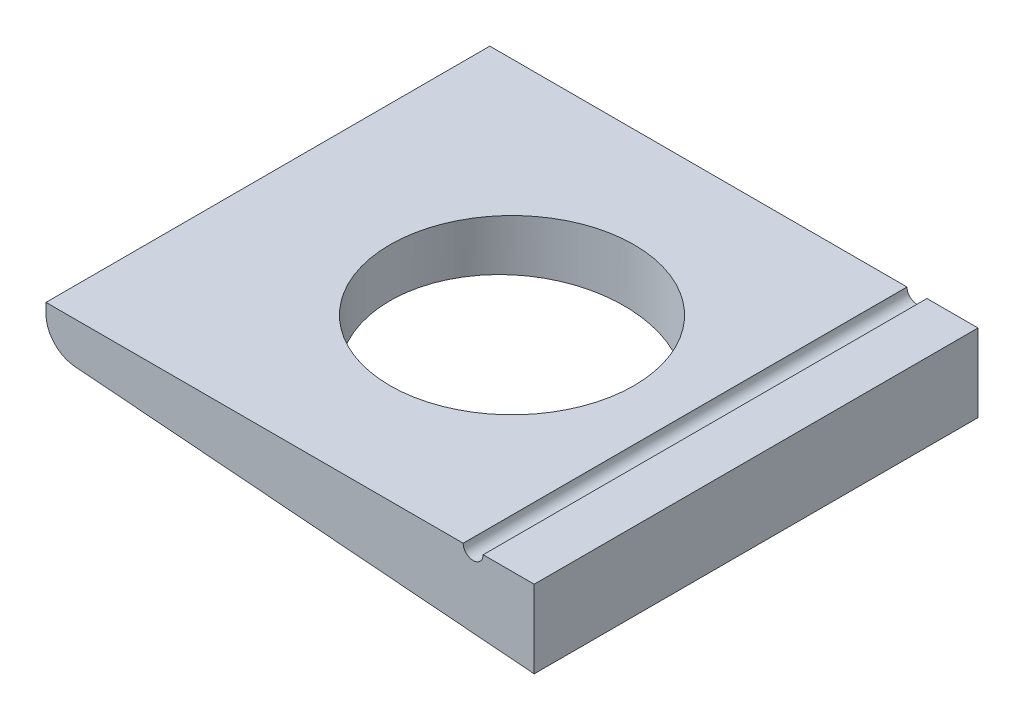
ISO-10303-21;
HEADER;
FILE_DESCRIPTION(('STEP AP214'),'2;1');
FILE_NAME('part.step','',(''),(''),'','','');
FILE_SCHEMA(('AUTOMOTIVE_DESIGN { 1 0 10303 214 1 1 1 1 }'));
ENDSEC;
DATA;
#1=APPLICATION_CONTEXT('core data for automotive mechanical design processes');
#2=APPLICATION_PROTOCOL_DEFINITION('international standard','automotive_design',2000,#1);
#3=PRODUCT_CONTEXT('',#1,'mechanical');
#4=PRODUCT('Part','Part','',(#3));
#5=PRODUCT_RELATED_PRODUCT_CATEGORY('part','',(#4));
#6=PRODUCT_DEFINITION_FORMATION('','',#4);
#7=PRODUCT_DEFINITION_CONTEXT('part definition',#1,'design');
#8=PRODUCT_DEFINITION('design','',#6,#7);
#9=PRODUCT_DEFINITION_SHAPE('','',#8);
#10=(LENGTH_UNIT() NAMED_UNIT(*) SI_UNIT(.MILLI.,.METRE.));
#11=(NAMED_UNIT(*) PLANE_ANGLE_UNIT() SI_UNIT($,.RADIAN.));
#12=(NAMED_UNIT(*) SI_UNIT($,.STERADIAN.) SOLID_ANGLE_UNIT());
#13=UNCERTAINTY_MEASURE_WITH_UNIT(LENGTH_MEASURE(1.E-05),#10,'distance_accuracy_value','');
#14=(GEOMETRIC_REPRESENTATION_CONTEXT(3) GLOBAL_UNCERTAINTY_ASSIGNED_CONTEXT((#13)) GLOBAL_UNIT_ASSIGNED_CONTEXT((#10,
#11,#12)) REPRESENTATION_CONTEXT('',''));
#15=CARTESIAN_POINT('',(0.,0.,0.));
#16=DIRECTION('',(0.,0.,1.));
#17=DIRECTION('',(1.,0.,0.));
#18=AXIS2_PLACEMENT_3D('',#15,#16,#17);
#19=CARTESIAN_POINT('',(22.,0.,20.));
#20=DIRECTION('',(0.,-1.,0.));
#21=DIRECTION('',(1.,0.,0.));
#22=AXIS2_PLACEMENT_3D('',#19,#20,#21);
#23=PLANE('',#22);
#24=DIRECTION('',(-1.,0.,0.));
#25=VECTOR('',#24,1.);
#26=CARTESIAN_POINT('',(22.,0.,-20.));
#27=LINE('',#26,#25);
#28=CARTESIAN_POINT('',(22.,0.,-20.));
#29=VERTEX_POINT('',#28);
#30=CARTESIAN_POINT('',(17.4,0.,-20.));
#31=VERTEX_POINT('',#30);
#32=EDGE_CURVE('E135',#29,#31,#27,.T.);
#33=ORIENTED_EDGE('',*,*,#32,.T.);
#34=DIRECTION('',(0.,0.,1.));
#35=VECTOR('',#34,1.);
#36=CARTESIAN_POINT('',(17.4,0.,-20.));
#37=LINE('',#36,#35);
#38=CARTESIAN_POINT('',(17.4,0.,20.));
#39=VERTEX_POINT('',#38);
#40=EDGE_CURVE('E53',#31,#39,#37,.T.);
#41=ORIENTED_EDGE('',*,*,#40,.T.);
#42=DIRECTION('',(-1.,0.,0.));
#43=VECTOR('',#42,1.);
#44=CARTESIAN_POINT('',(22.,0.,20.));
#45=LINE('',#44,#43);
#46=CARTESIAN_POINT('',(22.,0.,20.));
#47=VERTEX_POINT('',#46);
#48=EDGE_CURVE('E94',#47,#39,#45,.T.);
#49=ORIENTED_EDGE('',*,*,#48,.F.);
#50=DIRECTION('',(0.,0.,-1.));
#51=VECTOR('',#50,1.);
#52=CARTESIAN_POINT('',(22.,0.,20.));
#53=LINE('',#52,#51);
#54=EDGE_CURVE('E47',#47,#29,#53,.T.);
#55=ORIENTED_EDGE('',*,*,#54,.T.);
#56=EDGE_LOOP('',(#33,#41,#49,#55));
#57=FACE_BOUND('',#56,.T.);
#58=ADVANCED_FACE('F39',(#57),#23,.F.);
#59=CARTESIAN_POINT('',(22.,0.,20.));
#60=DIRECTION('',(-1.,0.,0.));
#61=DIRECTION('',(0.,0.,1.));
#62=AXIS2_PLACEMENT_3D('',#59,#60,#61);
#63=PLANE('',#62);
#64=DIRECTION('',(0.,1.,0.));
#65=VECTOR('',#64,1.);
#66=CARTESIAN_POINT('',(22.,0.,-20.));
#67=LINE('',#66,#65);
#68=CARTESIAN_POINT('',(22.,-7.,-20.));
#69=VERTEX_POINT('',#68);
#70=EDGE_CURVE('E130',#69,#29,#67,.T.);
#71=ORIENTED_EDGE('',*,*,#70,.T.);
#72=ORIENTED_EDGE('',*,*,#54,.F.);
#73=DIRECTION('',(0.,1.,0.));
#74=VECTOR('',#73,1.);
#75=CARTESIAN_POINT('',(22.,0.,20.));
#76=LINE('',#75,#74);
#77=CARTESIAN_POINT('',(22.,-7.,20.));
#78=VERTEX_POINT('',#77);
#79=EDGE_CURVE('E142',#78,#47,#76,.T.);
#80=ORIENTED_EDGE('',*,*,#79,.F.);
#81=DIRECTION('',(0.,0.,-1.));
#82=VECTOR('',#81,1.);
#83=CARTESIAN_POINT('',(22.,-7.,20.));
#84=LINE('',#83,#82);
#85=EDGE_CURVE('E126',#78,#69,#84,.T.);
#86=ORIENTED_EDGE('',*,*,#85,.T.);
#87=EDGE_LOOP('',(#71,#72,#80,#86));
#88=FACE_BOUND('',#87,.T.);
#89=ADVANCED_FACE('F41',(#88),#63,.F.);
#90=CARTESIAN_POINT('',(0.,0.,0.));
#91=DIRECTION('',(0.,1.,0.));
#92=DIRECTION('',(-1.,0.,0.));
#93=AXIS2_PLACEMENT_3D('',#90,#91,#92);
#94=CIRCLE('',#93,11.);
#95=CARTESIAN_POINT('',(-11.,0.,0.));
#96=VERTEX_POINT('',#95);
#97=EDGE_CURVE('E147',#96,#96,#94,.T.);
#98=ORIENTED_EDGE('',*,*,#97,.F.);
#99=EDGE_LOOP('',(#98));
#100=FACE_BOUND('',#99,.T.);
#101=CARTESIAN_POINT('',(15.6,0.,20.));
#102=VERTEX_POINT('',#101);
#103=CARTESIAN_POINT('',(-22.,0.,20.));
#104=VERTEX_POINT('',#103);
#105=EDGE_CURVE('E109',#102,#104,#45,.T.);
#106=ORIENTED_EDGE('',*,*,#105,.F.);
#107=DIRECTION('',(0.,0.,1.));
#108=VECTOR('',#107,1.);
#109=CARTESIAN_POINT('',(15.6,0.,-20.));
#110=LINE('',#109,#108);
#111=CARTESIAN_POINT('',(15.6,0.,-20.));
#112=VERTEX_POINT('',#111);
#113=EDGE_CURVE('E154',#102,#112,#110,.F.);
#114=ORIENTED_EDGE('',*,*,#113,.T.);
#115=CARTESIAN_POINT('',(-22.,0.,-20.));
#116=VERTEX_POINT('',#115);
#117=EDGE_CURVE('E133',#112,#116,#27,.T.);
#118=ORIENTED_EDGE('',*,*,#117,.T.);
#119=DIRECTION('',(0.,0.,-1.));
#120=VECTOR('',#119,1.);
#121=CARTESIAN_POINT('',(-22.,0.,20.));
#122=LINE('',#121,#120);
#123=EDGE_CURVE('E121',#104,#116,#122,.T.);
#124=ORIENTED_EDGE('',*,*,#123,.F.);
#125=EDGE_LOOP('',(#106,#114,#118,#124));
#126=FACE_BOUND('',#125,.T.);
#127=ADVANCED_FACE('F170',(#100,#126),#23,.F.);
#128=CARTESIAN_POINT('',(-22.,0.,20.));
#129=DIRECTION('',(1.,0.,0.));
#130=DIRECTION('',(0.,1.,0.));
#131=AXIS2_PLACEMENT_3D('',#128,#129,#130);
#132=PLANE('',#131);
#133=DIRECTION('',(0.,-1.,0.));
#134=VECTOR('',#133,1.);
#135=CARTESIAN_POINT('',(-22.,0.,-20.));
#136=LINE('',#135,#134);
#137=CARTESIAN_POINT('',(-22.,-0.913882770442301,-20.));
#138=VERTEX_POINT('',#137);
#139=EDGE_CURVE('E118',#116,#138,#136,.T.);
#140=ORIENTED_EDGE('',*,*,#139,.T.);
#141=DIRECTION('',(0.,0.,-1.));
#142=VECTOR('',#141,1.);
#143=CARTESIAN_POINT('',(-22.,-0.913882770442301,20.));
#144=LINE('',#143,#142);
#145=CARTESIAN_POINT('',(-22.,-0.913882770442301,20.));
#146=VERTEX_POINT('',#145);
#147=EDGE_CURVE('E115',#146,#138,#144,.T.);
#148=ORIENTED_EDGE('',*,*,#147,.F.);
#149=DIRECTION('',(0.,-1.,0.));
#150=VECTOR('',#149,1.);
#151=CARTESIAN_POINT('',(-22.,0.,20.));
#152=LINE('',#151,#150);
#153=EDGE_CURVE('E101',#104,#146,#152,.T.);
#154=ORIENTED_EDGE('',*,*,#153,.F.);
#155=ORIENTED_EDGE('',*,*,#123,.T.);
#156=EDGE_LOOP('',(#140,#148,#154,#155));
#157=FACE_BOUND('',#156,.T.);
#158=ADVANCED_FACE('F116',(#157),#132,.F.);
#159=CARTESIAN_POINT('',(-19.2,-0.9138827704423,20.));
#160=DIRECTION('',(0.,0.,-1.));
#161=DIRECTION('',(-1.,0.,0.));
#162=AXIS2_PLACEMENT_3D('',#159,#160,#161);
#163=CYLINDRICAL_SURFACE('',#162,2.8);
#164=CARTESIAN_POINT('',(-19.2,-0.9138827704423,-20.));
#165=DIRECTION('',(0.,0.,1.));
#166=DIRECTION('',(-1.,0.,0.));
#167=AXIS2_PLACEMENT_3D('',#164,#165,#166);
#168=CIRCLE('',#167,2.8);
#169=CARTESIAN_POINT('',(-19.4220259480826,-3.70506611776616,-20.));
#170=VERTEX_POINT('',#169);
#171=EDGE_CURVE('E139',#138,#170,#168,.T.);
#172=ORIENTED_EDGE('',*,*,#171,.T.);
#173=DIRECTION('',(0.,0.,-1.));
#174=VECTOR('',#173,1.);
#175=CARTESIAN_POINT('',(-19.4220259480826,-3.70506611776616,20.));
#176=LINE('',#175,#174);
#177=CARTESIAN_POINT('',(-19.4220259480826,-3.70506611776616,20.));
#178=VERTEX_POINT('',#177);
#179=EDGE_CURVE('E122',#178,#170,#176,.T.);
#180=ORIENTED_EDGE('',*,*,#179,.F.);
#181=CARTESIAN_POINT('',(-19.2,-0.9138827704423,20.));
#182=DIRECTION('',(0.,0.,1.));
#183=DIRECTION('',(-1.,0.,0.));
#184=AXIS2_PLACEMENT_3D('',#181,#182,#183);
#185=CIRCLE('',#184,2.8);
#186=EDGE_CURVE('E105',#146,#178,#185,.T.);
#187=ORIENTED_EDGE('',*,*,#186,.F.);
#188=ORIENTED_EDGE('',*,*,#147,.T.);
#189=EDGE_LOOP('',(#172,#180,#187,#188));
#190=FACE_BOUND('',#189,.T.);
#191=ADVANCED_FACE('F124',(#190),#163,.T.);
#192=CARTESIAN_POINT('',(22.,-7.,20.));
#193=DIRECTION('',(0.0792949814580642,0.996851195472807,0.));
#194=DIRECTION('',(-0.996851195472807,0.0792949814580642,0.));
#195=AXIS2_PLACEMENT_3D('',#192,#193,#194);
#196=PLANE('',#195);
#197=CARTESIAN_POINT('',(0.,-5.25,0.));
#198=DIRECTION('',(0.0792949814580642,0.996851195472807,0.));
#199=DIRECTION('',(-0.996851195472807,0.0792949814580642,0.));
#200=AXIS2_PLACEMENT_3D('',#197,#198,#199);
#201=ELLIPSE('',#200,11.0347462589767,11.);
#202=CARTESIAN_POINT('',(-11.,-4.375,0.));
#203=VERTEX_POINT('',#202);
#204=EDGE_CURVE('E134',#203,#203,#201,.T.);
#205=ORIENTED_EDGE('',*,*,#204,.T.);
#206=EDGE_LOOP('',(#205));
#207=FACE_BOUND('',#206,.T.);
#208=DIRECTION('',(0.996851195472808,-0.0792949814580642,0.));
#209=VECTOR('',#208,1.);
#210=CARTESIAN_POINT('',(22.,-7.,-20.));
#211=LINE('',#210,#209);
#212=EDGE_CURVE('E86',#170,#69,#211,.T.);
#213=ORIENTED_EDGE('',*,*,#212,.T.);
#214=ORIENTED_EDGE('',*,*,#85,.F.);
#215=DIRECTION('',(0.996851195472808,-0.0792949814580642,0.));
#216=VECTOR('',#215,1.);
#217=CARTESIAN_POINT('',(22.,-7.,20.));
#218=LINE('',#217,#216);
#219=EDGE_CURVE('E62',#178,#78,#218,.T.);
#220=ORIENTED_EDGE('',*,*,#219,.F.);
#221=ORIENTED_EDGE('',*,*,#179,.T.);
#222=EDGE_LOOP('',(#213,#214,#220,#221));
#223=FACE_BOUND('',#222,.T.);
#224=ADVANCED_FACE('F173',(#207,#223),#196,.F.);
#225=CARTESIAN_POINT('',(-19.2,-0.9138827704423,20.));
#226=DIRECTION('',(0.,0.,-1.));
#227=DIRECTION('',(-1.,0.,0.));
#228=AXIS2_PLACEMENT_3D('',#225,#226,#227);
#229=PLANE('',#228);
#230=ORIENTED_EDGE('',*,*,#48,.T.);
#231=CARTESIAN_POINT('',(16.5,0.,20.));
#232=DIRECTION('',(0.,0.,1.));
#233=DIRECTION('',(1.,0.,0.));
#234=AXIS2_PLACEMENT_3D('',#231,#232,#233);
#235=CIRCLE('',#234,0.9);
#236=EDGE_CURVE('E159',#102,#39,#235,.T.);
#237=ORIENTED_EDGE('',*,*,#236,.F.);
#238=ORIENTED_EDGE('',*,*,#105,.T.);
#239=ORIENTED_EDGE('',*,*,#153,.T.);
#240=ORIENTED_EDGE('',*,*,#186,.T.);
#241=ORIENTED_EDGE('',*,*,#219,.T.);
#242=ORIENTED_EDGE('',*,*,#79,.T.);
#243=EDGE_LOOP('',(#230,#237,#238,#239,#240,#241,#242));
#244=FACE_BOUND('',#243,.T.);
#245=ADVANCED_FACE('F103',(#244),#229,.F.);
#246=CARTESIAN_POINT('',(-19.2,-0.9138827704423,-20.));
#247=DIRECTION('',(0.,0.,-1.));
#248=DIRECTION('',(-1.,0.,0.));
#249=AXIS2_PLACEMENT_3D('',#246,#247,#248);
#250=PLANE('',#249);
#251=CARTESIAN_POINT('',(16.5,0.,-20.));
#252=DIRECTION('',(0.,0.,-1.));
#253=DIRECTION('',(-1.,0.,0.));
#254=AXIS2_PLACEMENT_3D('',#251,#252,#253);
#255=CIRCLE('',#254,0.9);
#256=EDGE_CURVE('E11',#31,#112,#255,.T.);
#257=ORIENTED_EDGE('',*,*,#256,.F.);
#258=ORIENTED_EDGE('',*,*,#32,.F.);
#259=ORIENTED_EDGE('',*,*,#70,.F.);
#260=ORIENTED_EDGE('',*,*,#212,.F.);
#261=ORIENTED_EDGE('',*,*,#171,.F.);
#262=ORIENTED_EDGE('',*,*,#139,.F.);
#263=ORIENTED_EDGE('',*,*,#117,.F.);
#264=EDGE_LOOP('',(#257,#258,#259,#260,#261,#262,#263));
#265=FACE_BOUND('',#264,.T.);
#266=ADVANCED_FACE('F171',(#265),#250,.T.);
#267=CARTESIAN_POINT('',(0.,-7.,0.));
#268=DIRECTION('',(0.,1.,0.));
#269=DIRECTION('',(-1.,0.,0.));
#270=AXIS2_PLACEMENT_3D('',#267,#268,#269);
#271=CYLINDRICAL_SURFACE('',#270,11.);
#272=ORIENTED_EDGE('',*,*,#97,.T.);
#273=EDGE_LOOP('',(#272));
#274=FACE_BOUND('',#273,.T.);
#275=ORIENTED_EDGE('',*,*,#204,.F.);
#276=EDGE_LOOP('',(#275));
#277=FACE_BOUND('',#276,.T.);
#278=ADVANCED_FACE('F196',(#274,#277),#271,.F.);
#279=CARTESIAN_POINT('',(16.5,0.,-20.));
#280=DIRECTION('',(0.,0.,1.));
#281=DIRECTION('',(1.,0.,0.));
#282=AXIS2_PLACEMENT_3D('',#279,#280,#281);
#283=CYLINDRICAL_SURFACE('',#282,0.9);
#284=ORIENTED_EDGE('',*,*,#256,.T.);
#285=ORIENTED_EDGE('',*,*,#113,.F.);
#286=ORIENTED_EDGE('',*,*,#236,.T.);
#287=ORIENTED_EDGE('',*,*,#40,.F.);
#288=EDGE_LOOP('',(#284,#285,#286,#287));
#289=FACE_BOUND('',#288,.T.);
#290=ADVANCED_FACE('F166',(#289),#283,.F.);
#291=CLOSED_SHELL('',(#58,#89,#127,#158,#191,#224,#245,#266,#278,#290));
#292=MANIFOLD_SOLID_BREP('B2',#291);
#293=ADVANCED_BREP_SHAPE_REPRESENTATION('',(#18,#292),#14);
#294=SHAPE_DEFINITION_REPRESENTATION(#9,#293);
ENDSEC;
END-ISO-10303-21;
